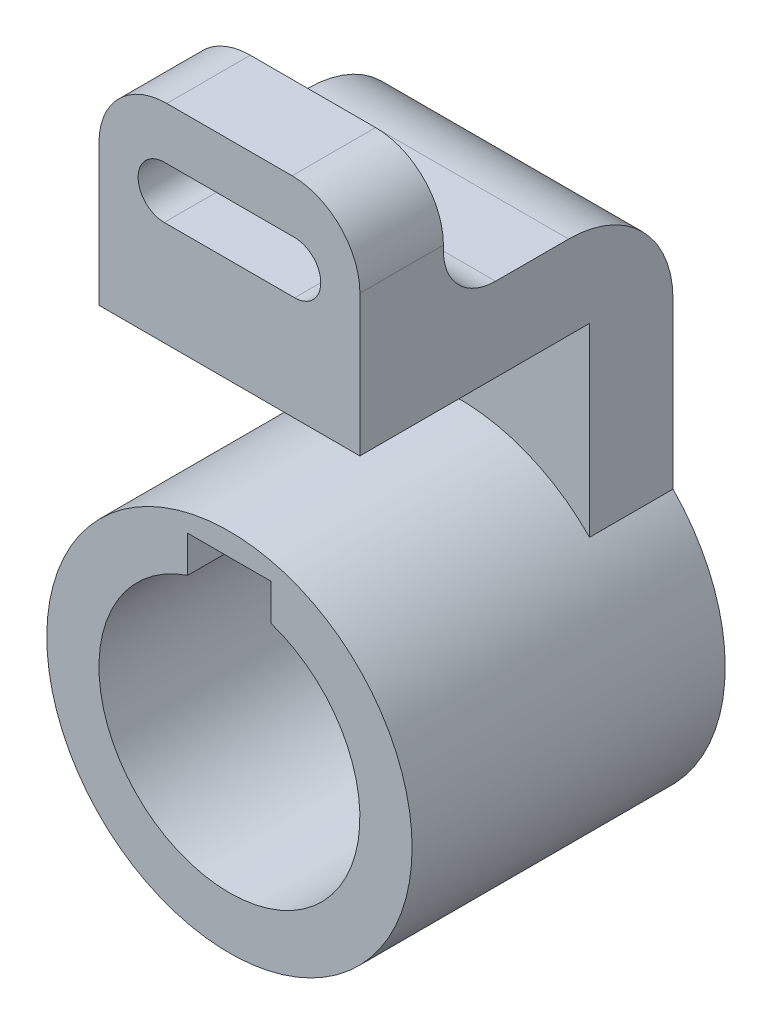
ISO-10303-21;
HEADER;
FILE_DESCRIPTION(('STEP AP214'),'2;1');
FILE_NAME('part.step','',(''),(''),'','','');
FILE_SCHEMA(('AUTOMOTIVE_DESIGN { 1 0 10303 214 1 1 1 1 }'));
ENDSEC;
DATA;
#1=APPLICATION_CONTEXT('core data for automotive mechanical design processes');
#2=APPLICATION_PROTOCOL_DEFINITION('international standard','automotive_design',2000,#1);
#3=PRODUCT_CONTEXT('',#1,'mechanical');
#4=PRODUCT('Part','Part','',(#3));
#5=PRODUCT_RELATED_PRODUCT_CATEGORY('part','',(#4));
#6=PRODUCT_DEFINITION_FORMATION('','',#4);
#7=PRODUCT_DEFINITION_CONTEXT('part definition',#1,'design');
#8=PRODUCT_DEFINITION('design','',#6,#7);
#9=PRODUCT_DEFINITION_SHAPE('','',#8);
#10=(LENGTH_UNIT() NAMED_UNIT(*) SI_UNIT(.MILLI.,.METRE.));
#11=(NAMED_UNIT(*) PLANE_ANGLE_UNIT() SI_UNIT($,.RADIAN.));
#12=(NAMED_UNIT(*) SI_UNIT($,.STERADIAN.) SOLID_ANGLE_UNIT());
#13=UNCERTAINTY_MEASURE_WITH_UNIT(LENGTH_MEASURE(1.E-05),#10,'distance_accuracy_value','');
#14=(GEOMETRIC_REPRESENTATION_CONTEXT(3) GLOBAL_UNCERTAINTY_ASSIGNED_CONTEXT((#13)) GLOBAL_UNIT_ASSIGNED_CONTEXT((#10,
#11,#12)) REPRESENTATION_CONTEXT('',''));
#15=CARTESIAN_POINT('',(0.,0.,0.));
#16=DIRECTION('',(0.,0.,1.));
#17=DIRECTION('',(1.,0.,0.));
#18=AXIS2_PLACEMENT_3D('',#15,#16,#17);
#19=CARTESIAN_POINT('',(0.,0.,60.));
#20=DIRECTION('',(0.,0.,-1.));
#21=DIRECTION('',(-1.,0.,0.));
#22=AXIS2_PLACEMENT_3D('',#19,#20,#21);
#23=CYLINDRICAL_SURFACE('',#22,35.);
#24=CARTESIAN_POINT('',(0.,0.,60.));
#25=DIRECTION('',(0.,0.,1.));
#26=DIRECTION('',(1.,0.,0.));
#27=AXIS2_PLACEMENT_3D('',#24,#25,#26);
#28=CIRCLE('',#27,35.);
#29=CARTESIAN_POINT('',(35.,0.,60.));
#30=VERTEX_POINT('',#29);
#31=EDGE_CURVE('E302',#30,#30,#28,.T.);
#32=ORIENTED_EDGE('',*,*,#31,.F.);
#33=EDGE_LOOP('',(#32));
#34=FACE_BOUND('',#33,.T.);
#35=CARTESIAN_POINT('',(0.,0.,0.));
#36=DIRECTION('',(0.,0.,1.));
#37=DIRECTION('',(1.,0.,0.));
#38=AXIS2_PLACEMENT_3D('',#35,#36,#37);
#39=CIRCLE('',#38,35.);
#40=CARTESIAN_POINT('',(-25.,24.4948974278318,0.));
#41=VERTEX_POINT('',#40);
#42=CARTESIAN_POINT('',(25.,24.4948974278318,0.));
#43=VERTEX_POINT('',#42);
#44=EDGE_CURVE('E300',#41,#43,#39,.T.);
#45=ORIENTED_EDGE('',*,*,#44,.T.);
#46=DIRECTION('',(0.,0.,-1.));
#47=VECTOR('',#46,1.);
#48=CARTESIAN_POINT('',(25.,24.4948974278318,60.));
#49=LINE('',#48,#47);
#50=CARTESIAN_POINT('',(25.,24.4948974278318,16.));
#51=VERTEX_POINT('',#50);
#52=EDGE_CURVE('E298',#43,#51,#49,.F.);
#53=ORIENTED_EDGE('',*,*,#52,.T.);
#54=CARTESIAN_POINT('',(0.,0.,16.));
#55=DIRECTION('',(0.,0.,-1.));
#56=DIRECTION('',(-1.,0.,0.));
#57=AXIS2_PLACEMENT_3D('',#54,#55,#56);
#58=CIRCLE('',#57,35.);
#59=CARTESIAN_POINT('',(-25.,24.4948974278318,16.));
#60=VERTEX_POINT('',#59);
#61=EDGE_CURVE('E305',#60,#51,#58,.T.);
#62=ORIENTED_EDGE('',*,*,#61,.F.);
#63=DIRECTION('',(0.,0.,-1.));
#64=VECTOR('',#63,1.);
#65=CARTESIAN_POINT('',(-25.,24.4948974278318,60.));
#66=LINE('',#65,#64);
#67=EDGE_CURVE('E295',#41,#60,#66,.F.);
#68=ORIENTED_EDGE('',*,*,#67,.F.);
#69=EDGE_LOOP('',(#45,#53,#62,#68));
#70=FACE_BOUND('',#69,.T.);
#71=ADVANCED_FACE('F45',(#34,#70),#23,.T.);
#72=CARTESIAN_POINT('',(0.,0.,60.));
#73=DIRECTION('',(0.,0.,1.));
#74=DIRECTION('',(1.,0.,0.));
#75=AXIS2_PLACEMENT_3D('',#72,#73,#74);
#76=PLANE('',#75);
#77=DIRECTION('',(-1.,0.,0.));
#78=VECTOR('',#77,1.);
#79=CARTESIAN_POINT('',(8.,30.685438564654,60.));
#80=LINE('',#79,#78);
#81=CARTESIAN_POINT('',(8.,30.685438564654,60.));
#82=VERTEX_POINT('',#81);
#83=CARTESIAN_POINT('',(-8.,30.685438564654,60.));
#84=VERTEX_POINT('',#83);
#85=EDGE_CURVE('E221',#82,#84,#80,.T.);
#86=ORIENTED_EDGE('',*,*,#85,.F.);
#87=DIRECTION('',(0.,1.,0.));
#88=VECTOR('',#87,1.);
#89=CARTESIAN_POINT('',(8.,23.685438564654,60.));
#90=LINE('',#89,#88);
#91=CARTESIAN_POINT('',(8.,23.685438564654,60.));
#92=VERTEX_POINT('',#91);
#93=EDGE_CURVE('E229',#92,#82,#90,.T.);
#94=ORIENTED_EDGE('',*,*,#93,.F.);
#95=CARTESIAN_POINT('',(0.,0.,60.));
#96=DIRECTION('',(0.,0.,1.));
#97=DIRECTION('',(1.,0.,0.));
#98=AXIS2_PLACEMENT_3D('',#95,#96,#97);
#99=CIRCLE('',#98,25.);
#100=CARTESIAN_POINT('',(-8.,23.685438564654,60.));
#101=VERTEX_POINT('',#100);
#102=EDGE_CURVE('E226',#101,#92,#99,.T.);
#103=ORIENTED_EDGE('',*,*,#102,.F.);
#104=DIRECTION('',(0.,-1.,0.));
#105=VECTOR('',#104,1.);
#106=CARTESIAN_POINT('',(-8.,23.685438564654,60.));
#107=LINE('',#106,#105);
#108=EDGE_CURVE('E223',#84,#101,#107,.T.);
#109=ORIENTED_EDGE('',*,*,#108,.F.);
#110=EDGE_LOOP('',(#86,#94,#103,#109));
#111=FACE_BOUND('',#110,.T.);
#112=ORIENTED_EDGE('',*,*,#31,.T.);
#113=EDGE_LOOP('',(#112));
#114=FACE_BOUND('',#113,.T.);
#115=ADVANCED_FACE('F383',(#111,#114),#76,.T.);
#116=CARTESIAN_POINT('',(0.,0.,0.));
#117=DIRECTION('',(0.,0.,1.));
#118=DIRECTION('',(1.,0.,0.));
#119=AXIS2_PLACEMENT_3D('',#116,#117,#118);
#120=PLANE('',#119);
#121=DIRECTION('',(0.,1.,0.));
#122=VECTOR('',#121,1.);
#123=CARTESIAN_POINT('',(8.,23.685438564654,0.));
#124=LINE('',#123,#122);
#125=CARTESIAN_POINT('',(8.,23.685438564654,0.));
#126=VERTEX_POINT('',#125);
#127=CARTESIAN_POINT('',(8.,30.685438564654,0.));
#128=VERTEX_POINT('',#127);
#129=EDGE_CURVE('E241',#126,#128,#124,.T.);
#130=ORIENTED_EDGE('',*,*,#129,.T.);
#131=DIRECTION('',(-1.,0.,0.));
#132=VECTOR('',#131,1.);
#133=CARTESIAN_POINT('',(8.,30.685438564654,0.));
#134=LINE('',#133,#132);
#135=CARTESIAN_POINT('',(-8.,30.685438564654,0.));
#136=VERTEX_POINT('',#135);
#137=EDGE_CURVE('E232',#128,#136,#134,.T.);
#138=ORIENTED_EDGE('',*,*,#137,.T.);
#139=DIRECTION('',(0.,-1.,0.));
#140=VECTOR('',#139,1.);
#141=CARTESIAN_POINT('',(-8.,23.685438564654,0.));
#142=LINE('',#141,#140);
#143=CARTESIAN_POINT('',(-8.,23.685438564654,0.));
#144=VERTEX_POINT('',#143);
#145=EDGE_CURVE('E235',#136,#144,#142,.T.);
#146=ORIENTED_EDGE('',*,*,#145,.T.);
#147=CARTESIAN_POINT('',(0.,0.,0.));
#148=DIRECTION('',(0.,0.,1.));
#149=DIRECTION('',(1.,0.,0.));
#150=AXIS2_PLACEMENT_3D('',#147,#148,#149);
#151=CIRCLE('',#150,25.);
#152=EDGE_CURVE('E238',#144,#126,#151,.T.);
#153=ORIENTED_EDGE('',*,*,#152,.T.);
#154=EDGE_LOOP('',(#130,#138,#146,#153));
#155=FACE_BOUND('',#154,.T.);
#156=DIRECTION('',(0.,1.,0.));
#157=VECTOR('',#156,1.);
#158=CARTESIAN_POINT('',(-25.,0.,0.));
#159=LINE('',#158,#157);
#160=CARTESIAN_POINT('',(-25.,56.,0.));
#161=VERTEX_POINT('',#160);
#162=EDGE_CURVE('E247',#41,#161,#159,.T.);
#163=ORIENTED_EDGE('',*,*,#162,.T.);
#164=DIRECTION('',(-1.,0.,0.));
#165=VECTOR('',#164,1.);
#166=CARTESIAN_POINT('',(0.,56.,0.));
#167=LINE('',#166,#165);
#168=CARTESIAN_POINT('',(25.,56.,0.));
#169=VERTEX_POINT('',#168);
#170=EDGE_CURVE('E333',#161,#169,#167,.F.);
#171=ORIENTED_EDGE('',*,*,#170,.T.);
#172=DIRECTION('',(0.,1.,0.));
#173=VECTOR('',#172,1.);
#174=CARTESIAN_POINT('',(25.,0.,0.));
#175=LINE('',#174,#173);
#176=EDGE_CURVE('E268',#43,#169,#175,.T.);
#177=ORIENTED_EDGE('',*,*,#176,.F.);
#178=ORIENTED_EDGE('',*,*,#44,.F.);
#179=EDGE_LOOP('',(#163,#171,#177,#178));
#180=FACE_BOUND('',#179,.T.);
#181=ADVANCED_FACE('F388',(#155,#180),#120,.F.);
#182=CARTESIAN_POINT('',(25.,0.,16.));
#183=DIRECTION('',(0.,0.,-1.));
#184=DIRECTION('',(-1.,0.,0.));
#185=AXIS2_PLACEMENT_3D('',#182,#183,#184);
#186=PLANE('',#185);
#187=DIRECTION('',(0.,-1.,0.));
#188=VECTOR('',#187,1.);
#189=CARTESIAN_POINT('',(-25.,0.,16.));
#190=LINE('',#189,#188);
#191=CARTESIAN_POINT('',(-25.,60.,16.));
#192=VERTEX_POINT('',#191);
#193=EDGE_CURVE('E265',#192,#60,#190,.T.);
#194=ORIENTED_EDGE('',*,*,#193,.T.);
#195=ORIENTED_EDGE('',*,*,#61,.T.);
#196=DIRECTION('',(0.,-1.,0.));
#197=VECTOR('',#196,1.);
#198=CARTESIAN_POINT('',(25.,0.,16.));
#199=LINE('',#198,#197);
#200=CARTESIAN_POINT('',(25.,60.,16.));
#201=VERTEX_POINT('',#200);
#202=EDGE_CURVE('E280',#201,#51,#199,.T.);
#203=ORIENTED_EDGE('',*,*,#202,.F.);
#204=DIRECTION('',(-1.,0.,0.));
#205=VECTOR('',#204,1.);
#206=CARTESIAN_POINT('',(25.,60.,16.));
#207=LINE('',#206,#205);
#208=EDGE_CURVE('E283',#201,#192,#207,.T.);
#209=ORIENTED_EDGE('',*,*,#208,.T.);
#210=EDGE_LOOP('',(#194,#195,#203,#209));
#211=FACE_BOUND('',#210,.T.);
#212=ADVANCED_FACE('F433',(#211),#186,.F.);
#213=CARTESIAN_POINT('',(25.,0.,0.));
#214=DIRECTION('',(1.,0.,0.));
#215=DIRECTION('',(0.,0.,-1.));
#216=AXIS2_PLACEMENT_3D('',#213,#214,#215);
#217=PLANE('',#216);
#218=ORIENTED_EDGE('',*,*,#176,.T.);
#219=CARTESIAN_POINT('',(25.,56.,20.));
#220=DIRECTION('',(1.,0.,0.));
#221=DIRECTION('',(0.,0.,-1.));
#222=AXIS2_PLACEMENT_3D('',#219,#220,#221);
#223=CIRCLE('',#222,20.);
#224=CARTESIAN_POINT('',(25.,76.,20.));
#225=VERTEX_POINT('',#224);
#226=EDGE_CURVE('E335',#169,#225,#223,.T.);
#227=ORIENTED_EDGE('',*,*,#226,.T.);
#228=DIRECTION('',(0.,0.,1.));
#229=VECTOR('',#228,1.);
#230=CARTESIAN_POINT('',(25.,76.,0.));
#231=LINE('',#230,#229);
#232=CARTESIAN_POINT('',(25.,76.,34.));
#233=VERTEX_POINT('',#232);
#234=EDGE_CURVE('E271',#225,#233,#231,.T.);
#235=ORIENTED_EDGE('',*,*,#234,.T.);
#236=CARTESIAN_POINT('',(25.,86.,34.));
#237=DIRECTION('',(1.,0.,0.));
#238=DIRECTION('',(0.,0.,-1.));
#239=AXIS2_PLACEMENT_3D('',#236,#237,#238);
#240=CIRCLE('',#239,10.);
#241=CARTESIAN_POINT('',(25.,86.,44.));
#242=VERTEX_POINT('',#241);
#243=EDGE_CURVE('E13',#233,#242,#240,.F.);
#244=ORIENTED_EDGE('',*,*,#243,.T.);
#245=DIRECTION('',(0.,1.,0.));
#246=VECTOR('',#245,1.);
#247=CARTESIAN_POINT('',(25.,76.,44.));
#248=LINE('',#247,#246);
#249=CARTESIAN_POINT('',(25.,87.,44.));
#250=VERTEX_POINT('',#249);
#251=EDGE_CURVE('E274',#242,#250,#248,.T.);
#252=ORIENTED_EDGE('',*,*,#251,.T.);
#253=DIRECTION('',(0.,0.,1.));
#254=VECTOR('',#253,1.);
#255=CARTESIAN_POINT('',(25.,87.,60.));
#256=LINE('',#255,#254);
#257=CARTESIAN_POINT('',(25.,87.,60.));
#258=VERTEX_POINT('',#257);
#259=EDGE_CURVE('E325',#250,#258,#256,.T.);
#260=ORIENTED_EDGE('',*,*,#259,.T.);
#261=DIRECTION('',(0.,-1.,0.));
#262=VECTOR('',#261,1.);
#263=CARTESIAN_POINT('',(25.,60.,60.));
#264=LINE('',#263,#262);
#265=CARTESIAN_POINT('',(25.,60.,60.));
#266=VERTEX_POINT('',#265);
#267=EDGE_CURVE('E276',#258,#266,#264,.T.);
#268=ORIENTED_EDGE('',*,*,#267,.T.);
#269=DIRECTION('',(0.,0.,-1.));
#270=VECTOR('',#269,1.);
#271=CARTESIAN_POINT('',(25.,60.,16.));
#272=LINE('',#271,#270);
#273=EDGE_CURVE('E278',#266,#201,#272,.T.);
#274=ORIENTED_EDGE('',*,*,#273,.T.);
#275=ORIENTED_EDGE('',*,*,#202,.T.);
#276=ORIENTED_EDGE('',*,*,#52,.F.);
#277=EDGE_LOOP('',(#218,#227,#235,#244,#252,#260,#268,#274,#275,#276));
#278=FACE_BOUND('',#277,.T.);
#279=ADVANCED_FACE('F398',(#278),#217,.T.);
#280=CARTESIAN_POINT('',(-25.,0.,0.));
#281=DIRECTION('',(1.,0.,0.));
#282=DIRECTION('',(0.,0.,-1.));
#283=AXIS2_PLACEMENT_3D('',#280,#281,#282);
#284=PLANE('',#283);
#285=DIRECTION('',(0.,0.,1.));
#286=VECTOR('',#285,1.);
#287=CARTESIAN_POINT('',(-25.,76.,0.));
#288=LINE('',#287,#286);
#289=CARTESIAN_POINT('',(-25.,76.,20.));
#290=VERTEX_POINT('',#289);
#291=CARTESIAN_POINT('',(-25.,76.,34.));
#292=VERTEX_POINT('',#291);
#293=EDGE_CURVE('E256',#290,#292,#288,.T.);
#294=ORIENTED_EDGE('',*,*,#293,.F.);
#295=CARTESIAN_POINT('',(-25.,56.,20.));
#296=DIRECTION('',(1.,0.,0.));
#297=DIRECTION('',(0.,0.,-1.));
#298=AXIS2_PLACEMENT_3D('',#295,#296,#297);
#299=CIRCLE('',#298,20.);
#300=EDGE_CURVE('E331',#290,#161,#299,.F.);
#301=ORIENTED_EDGE('',*,*,#300,.T.);
#302=ORIENTED_EDGE('',*,*,#162,.F.);
#303=ORIENTED_EDGE('',*,*,#67,.T.);
#304=ORIENTED_EDGE('',*,*,#193,.F.);
#305=DIRECTION('',(0.,0.,-1.));
#306=VECTOR('',#305,1.);
#307=CARTESIAN_POINT('',(-25.,60.,16.));
#308=LINE('',#307,#306);
#309=CARTESIAN_POINT('',(-25.,60.,60.));
#310=VERTEX_POINT('',#309);
#311=EDGE_CURVE('E263',#310,#192,#308,.T.);
#312=ORIENTED_EDGE('',*,*,#311,.F.);
#313=DIRECTION('',(0.,-1.,0.));
#314=VECTOR('',#313,1.);
#315=CARTESIAN_POINT('',(-25.,60.,60.));
#316=LINE('',#315,#314);
#317=CARTESIAN_POINT('',(-25.,87.,60.));
#318=VERTEX_POINT('',#317);
#319=EDGE_CURVE('E261',#318,#310,#316,.T.);
#320=ORIENTED_EDGE('',*,*,#319,.F.);
#321=DIRECTION('',(0.,0.,1.));
#322=VECTOR('',#321,1.);
#323=CARTESIAN_POINT('',(-25.,87.,0.));
#324=LINE('',#323,#322);
#325=CARTESIAN_POINT('',(-25.,87.,44.));
#326=VERTEX_POINT('',#325);
#327=EDGE_CURVE('E317',#318,#326,#324,.F.);
#328=ORIENTED_EDGE('',*,*,#327,.T.);
#329=DIRECTION('',(0.,1.,0.));
#330=VECTOR('',#329,1.);
#331=CARTESIAN_POINT('',(-25.,76.,44.));
#332=LINE('',#331,#330);
#333=CARTESIAN_POINT('',(-25.,86.,44.));
#334=VERTEX_POINT('',#333);
#335=EDGE_CURVE('E259',#334,#326,#332,.T.);
#336=ORIENTED_EDGE('',*,*,#335,.F.);
#337=CARTESIAN_POINT('',(-25.,86.,34.));
#338=DIRECTION('',(1.,0.,0.));
#339=DIRECTION('',(0.,0.,-1.));
#340=AXIS2_PLACEMENT_3D('',#337,#338,#339);
#341=CIRCLE('',#340,10.);
#342=EDGE_CURVE('E52',#334,#292,#341,.T.);
#343=ORIENTED_EDGE('',*,*,#342,.T.);
#344=EDGE_LOOP('',(#294,#301,#302,#303,#304,#312,#320,#328,#336,#343));
#345=FACE_BOUND('',#344,.T.);
#346=ADVANCED_FACE('F435',(#345),#284,.F.);
#347=CARTESIAN_POINT('',(25.,76.,0.));
#348=DIRECTION('',(0.,-1.,0.));
#349=DIRECTION('',(0.,0.,-1.));
#350=AXIS2_PLACEMENT_3D('',#347,#348,#349);
#351=PLANE('',#350);
#352=ORIENTED_EDGE('',*,*,#293,.T.);
#353=DIRECTION('',(-1.,0.,0.));
#354=VECTOR('',#353,1.);
#355=CARTESIAN_POINT('',(25.,76.,34.));
#356=LINE('',#355,#354);
#357=EDGE_CURVE('E342',#292,#233,#356,.F.);
#358=ORIENTED_EDGE('',*,*,#357,.T.);
#359=ORIENTED_EDGE('',*,*,#234,.F.);
#360=DIRECTION('',(-1.,0.,0.));
#361=VECTOR('',#360,1.);
#362=CARTESIAN_POINT('',(25.,76.,20.));
#363=LINE('',#362,#361);
#364=EDGE_CURVE('E328',#225,#290,#363,.T.);
#365=ORIENTED_EDGE('',*,*,#364,.T.);
#366=EDGE_LOOP('',(#352,#358,#359,#365));
#367=FACE_BOUND('',#366,.T.);
#368=ADVANCED_FACE('F407',(#367),#351,.F.);
#369=CARTESIAN_POINT('',(25.,76.,44.));
#370=DIRECTION('',(0.,0.,1.));
#371=DIRECTION('',(1.,0.,0.));
#372=AXIS2_PLACEMENT_3D('',#369,#370,#371);
#373=PLANE('',#372);
#374=ORIENTED_EDGE('',*,*,#251,.F.);
#375=DIRECTION('',(-1.,0.,0.));
#376=VECTOR('',#375,1.);
#377=CARTESIAN_POINT('',(-25.,86.,44.));
#378=LINE('',#377,#376);
#379=CARTESIAN_POINT('',(17.3989794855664,86.,44.));
#380=VERTEX_POINT('',#379);
#381=EDGE_CURVE('E339',#242,#380,#378,.T.);
#382=ORIENTED_EDGE('',*,*,#381,.T.);
#383=CARTESIAN_POINT('',(12.5,85.,44.));
#384=DIRECTION('',(0.,0.,1.));
#385=DIRECTION('',(1.,0.,0.));
#386=AXIS2_PLACEMENT_3D('',#383,#384,#385);
#387=CIRCLE('',#386,5.);
#388=CARTESIAN_POINT('',(12.5,90.,44.));
#389=VERTEX_POINT('',#388);
#390=EDGE_CURVE('E219',#380,#389,#387,.T.);
#391=ORIENTED_EDGE('',*,*,#390,.T.);
#392=DIRECTION('',(-1.,0.,0.));
#393=VECTOR('',#392,1.);
#394=CARTESIAN_POINT('',(25.,90.,44.));
#395=LINE('',#394,#393);
#396=CARTESIAN_POINT('',(-12.5,90.,44.));
#397=VERTEX_POINT('',#396);
#398=EDGE_CURVE('E214',#389,#397,#395,.T.);
#399=ORIENTED_EDGE('',*,*,#398,.T.);
#400=CARTESIAN_POINT('',(-12.5,85.,44.));
#401=DIRECTION('',(0.,0.,1.));
#402=DIRECTION('',(1.,0.,0.));
#403=AXIS2_PLACEMENT_3D('',#400,#401,#402);
#404=CIRCLE('',#403,5.);
#405=CARTESIAN_POINT('',(-17.3989794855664,86.,44.));
#406=VERTEX_POINT('',#405);
#407=EDGE_CURVE('E191',#397,#406,#404,.T.);
#408=ORIENTED_EDGE('',*,*,#407,.T.);
#409=DIRECTION('',(-1.,0.,0.));
#410=VECTOR('',#409,1.);
#411=CARTESIAN_POINT('',(-25.,86.,44.));
#412=LINE('',#411,#410);
#413=EDGE_CURVE('E337',#406,#334,#412,.T.);
#414=ORIENTED_EDGE('',*,*,#413,.T.);
#415=ORIENTED_EDGE('',*,*,#335,.T.);
#416=CARTESIAN_POINT('',(-12.,87.,44.));
#417=DIRECTION('',(0.,0.,1.));
#418=DIRECTION('',(1.,0.,0.));
#419=AXIS2_PLACEMENT_3D('',#416,#417,#418);
#420=CIRCLE('',#419,13.);
#421=CARTESIAN_POINT('',(-12.,100.,44.));
#422=VERTEX_POINT('',#421);
#423=EDGE_CURVE('E323',#326,#422,#420,.F.);
#424=ORIENTED_EDGE('',*,*,#423,.T.);
#425=DIRECTION('',(-1.,0.,0.));
#426=VECTOR('',#425,1.);
#427=CARTESIAN_POINT('',(25.,100.,44.));
#428=LINE('',#427,#426);
#429=CARTESIAN_POINT('',(12.,100.,44.));
#430=VERTEX_POINT('',#429);
#431=EDGE_CURVE('E292',#430,#422,#428,.T.);
#432=ORIENTED_EDGE('',*,*,#431,.F.);
#433=CARTESIAN_POINT('',(12.,87.,44.));
#434=DIRECTION('',(0.,0.,1.));
#435=DIRECTION('',(1.,0.,0.));
#436=AXIS2_PLACEMENT_3D('',#433,#434,#435);
#437=CIRCLE('',#436,13.);
#438=EDGE_CURVE('E320',#430,#250,#437,.F.);
#439=ORIENTED_EDGE('',*,*,#438,.T.);
#440=EDGE_LOOP('',(#374,#382,#391,#399,#408,#414,#415,#424,#432,#439));
#441=FACE_BOUND('',#440,.T.);
#442=ADVANCED_FACE('F415',(#441),#373,.F.);
#443=CARTESIAN_POINT('',(25.,100.,44.));
#444=DIRECTION('',(0.,-1.,0.));
#445=DIRECTION('',(0.,0.,-1.));
#446=AXIS2_PLACEMENT_3D('',#443,#444,#445);
#447=PLANE('',#446);
#448=ORIENTED_EDGE('',*,*,#431,.T.);
#449=DIRECTION('',(0.,0.,1.));
#450=VECTOR('',#449,1.);
#451=CARTESIAN_POINT('',(-12.,100.,44.));
#452=LINE('',#451,#450);
#453=CARTESIAN_POINT('',(-12.,100.,60.));
#454=VERTEX_POINT('',#453);
#455=EDGE_CURVE('E310',#422,#454,#452,.T.);
#456=ORIENTED_EDGE('',*,*,#455,.T.);
#457=DIRECTION('',(-1.,0.,0.));
#458=VECTOR('',#457,1.);
#459=CARTESIAN_POINT('',(25.,100.,60.));
#460=LINE('',#459,#458);
#461=CARTESIAN_POINT('',(12.,100.,60.));
#462=VERTEX_POINT('',#461);
#463=EDGE_CURVE('E289',#462,#454,#460,.T.);
#464=ORIENTED_EDGE('',*,*,#463,.F.);
#465=DIRECTION('',(0.,0.,1.));
#466=VECTOR('',#465,1.);
#467=CARTESIAN_POINT('',(12.,100.,44.));
#468=LINE('',#467,#466);
#469=EDGE_CURVE('E308',#462,#430,#468,.F.);
#470=ORIENTED_EDGE('',*,*,#469,.T.);
#471=EDGE_LOOP('',(#448,#456,#464,#470));
#472=FACE_BOUND('',#471,.T.);
#473=ADVANCED_FACE('F472',(#472),#447,.F.);
#474=CARTESIAN_POINT('',(25.,60.,60.));
#475=DIRECTION('',(0.,0.,-1.));
#476=DIRECTION('',(-1.,0.,0.));
#477=AXIS2_PLACEMENT_3D('',#474,#475,#476);
#478=PLANE('',#477);
#479=DIRECTION('',(-1.,0.,0.));
#480=VECTOR('',#479,1.);
#481=CARTESIAN_POINT('',(-12.5,90.,60.));
#482=LINE('',#481,#480);
#483=CARTESIAN_POINT('',(12.5,90.,60.));
#484=VERTEX_POINT('',#483);
#485=CARTESIAN_POINT('',(-12.5,90.,60.));
#486=VERTEX_POINT('',#485);
#487=EDGE_CURVE('E199',#484,#486,#482,.T.);
#488=ORIENTED_EDGE('',*,*,#487,.F.);
#489=CARTESIAN_POINT('',(12.5,85.,60.));
#490=DIRECTION('',(0.,0.,1.));
#491=DIRECTION('',(-1.,0.,0.));
#492=AXIS2_PLACEMENT_3D('',#489,#490,#491);
#493=CIRCLE('',#492,5.);
#494=CARTESIAN_POINT('',(12.5,80.,60.));
#495=VERTEX_POINT('',#494);
#496=EDGE_CURVE('E204',#495,#484,#493,.T.);
#497=ORIENTED_EDGE('',*,*,#496,.F.);
#498=DIRECTION('',(1.,0.,0.));
#499=VECTOR('',#498,1.);
#500=CARTESIAN_POINT('',(12.5,80.,60.));
#501=LINE('',#500,#499);
#502=CARTESIAN_POINT('',(-12.5,80.,60.));
#503=VERTEX_POINT('',#502);
#504=EDGE_CURVE('E208',#503,#495,#501,.T.);
#505=ORIENTED_EDGE('',*,*,#504,.F.);
#506=CARTESIAN_POINT('',(-12.5,85.,60.));
#507=DIRECTION('',(0.,0.,1.));
#508=DIRECTION('',(1.,0.,0.));
#509=AXIS2_PLACEMENT_3D('',#506,#507,#508);
#510=CIRCLE('',#509,5.);
#511=EDGE_CURVE('E188',#486,#503,#510,.T.);
#512=ORIENTED_EDGE('',*,*,#511,.F.);
#513=EDGE_LOOP('',(#488,#497,#505,#512));
#514=FACE_BOUND('',#513,.T.);
#515=ORIENTED_EDGE('',*,*,#463,.T.);
#516=CARTESIAN_POINT('',(-12.,87.,60.));
#517=DIRECTION('',(0.,0.,-1.));
#518=DIRECTION('',(-1.,0.,0.));
#519=AXIS2_PLACEMENT_3D('',#516,#517,#518);
#520=CIRCLE('',#519,13.);
#521=EDGE_CURVE('E315',#454,#318,#520,.F.);
#522=ORIENTED_EDGE('',*,*,#521,.T.);
#523=ORIENTED_EDGE('',*,*,#319,.T.);
#524=DIRECTION('',(-1.,0.,0.));
#525=VECTOR('',#524,1.);
#526=CARTESIAN_POINT('',(25.,60.,60.));
#527=LINE('',#526,#525);
#528=EDGE_CURVE('E286',#266,#310,#527,.T.);
#529=ORIENTED_EDGE('',*,*,#528,.F.);
#530=ORIENTED_EDGE('',*,*,#267,.F.);
#531=CARTESIAN_POINT('',(12.,87.,60.));
#532=DIRECTION('',(0.,0.,-1.));
#533=DIRECTION('',(-1.,0.,0.));
#534=AXIS2_PLACEMENT_3D('',#531,#532,#533);
#535=CIRCLE('',#534,13.);
#536=EDGE_CURVE('E313',#258,#462,#535,.F.);
#537=ORIENTED_EDGE('',*,*,#536,.T.);
#538=EDGE_LOOP('',(#515,#522,#523,#529,#530,#537));
#539=FACE_BOUND('',#538,.T.);
#540=ADVANCED_FACE('F206',(#514,#539),#478,.F.);
#541=CARTESIAN_POINT('',(25.,60.,16.));
#542=DIRECTION('',(0.,1.,0.));
#543=DIRECTION('',(0.,0.,1.));
#544=AXIS2_PLACEMENT_3D('',#541,#542,#543);
#545=PLANE('',#544);
#546=ORIENTED_EDGE('',*,*,#311,.T.);
#547=ORIENTED_EDGE('',*,*,#208,.F.);
#548=ORIENTED_EDGE('',*,*,#273,.F.);
#549=ORIENTED_EDGE('',*,*,#528,.T.);
#550=EDGE_LOOP('',(#546,#547,#548,#549));
#551=FACE_BOUND('',#550,.T.);
#552=ADVANCED_FACE('F430',(#551),#545,.F.);
#553=CARTESIAN_POINT('',(8.,30.685438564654,0.));
#554=DIRECTION('',(0.,1.,0.));
#555=DIRECTION('',(0.,0.,1.));
#556=AXIS2_PLACEMENT_3D('',#553,#554,#555);
#557=PLANE('',#556);
#558=ORIENTED_EDGE('',*,*,#85,.T.);
#559=DIRECTION('',(0.,0.,1.));
#560=VECTOR('',#559,1.);
#561=CARTESIAN_POINT('',(-8.,30.685438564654,0.));
#562=LINE('',#561,#560);
#563=EDGE_CURVE('E244',#136,#84,#562,.T.);
#564=ORIENTED_EDGE('',*,*,#563,.F.);
#565=ORIENTED_EDGE('',*,*,#137,.F.);
#566=DIRECTION('',(0.,0.,1.));
#567=VECTOR('',#566,1.);
#568=CARTESIAN_POINT('',(8.,30.685438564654,0.));
#569=LINE('',#568,#567);
#570=EDGE_CURVE('E245',#128,#82,#569,.T.);
#571=ORIENTED_EDGE('',*,*,#570,.T.);
#572=EDGE_LOOP('',(#558,#564,#565,#571));
#573=FACE_BOUND('',#572,.T.);
#574=ADVANCED_FACE('F458',(#573),#557,.F.);
#575=CARTESIAN_POINT('',(8.,23.685438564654,0.));
#576=DIRECTION('',(1.,0.,0.));
#577=DIRECTION('',(0.,0.,-1.));
#578=AXIS2_PLACEMENT_3D('',#575,#576,#577);
#579=PLANE('',#578);
#580=ORIENTED_EDGE('',*,*,#93,.T.);
#581=ORIENTED_EDGE('',*,*,#570,.F.);
#582=ORIENTED_EDGE('',*,*,#129,.F.);
#583=DIRECTION('',(0.,0.,1.));
#584=VECTOR('',#583,1.);
#585=CARTESIAN_POINT('',(8.,23.685438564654,0.));
#586=LINE('',#585,#584);
#587=EDGE_CURVE('E248',#126,#92,#586,.T.);
#588=ORIENTED_EDGE('',*,*,#587,.T.);
#589=EDGE_LOOP('',(#580,#581,#582,#588));
#590=FACE_BOUND('',#589,.T.);
#591=ADVANCED_FACE('F454',(#590),#579,.F.);
#592=CARTESIAN_POINT('',(0.,0.,0.));
#593=DIRECTION('',(0.,0.,1.));
#594=DIRECTION('',(1.,0.,0.));
#595=AXIS2_PLACEMENT_3D('',#592,#593,#594);
#596=CYLINDRICAL_SURFACE('',#595,25.);
#597=ORIENTED_EDGE('',*,*,#102,.T.);
#598=ORIENTED_EDGE('',*,*,#587,.F.);
#599=ORIENTED_EDGE('',*,*,#152,.F.);
#600=DIRECTION('',(0.,0.,1.));
#601=VECTOR('',#600,1.);
#602=CARTESIAN_POINT('',(-8.,23.685438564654,0.));
#603=LINE('',#602,#601);
#604=EDGE_CURVE('E250',#144,#101,#603,.T.);
#605=ORIENTED_EDGE('',*,*,#604,.T.);
#606=EDGE_LOOP('',(#597,#598,#599,#605));
#607=FACE_BOUND('',#606,.T.);
#608=ADVANCED_FACE('F448',(#607),#596,.F.);
#609=CARTESIAN_POINT('',(-8.,23.685438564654,0.));
#610=DIRECTION('',(-1.,0.,0.));
#611=DIRECTION('',(0.,0.,1.));
#612=AXIS2_PLACEMENT_3D('',#609,#610,#611);
#613=PLANE('',#612);
#614=ORIENTED_EDGE('',*,*,#108,.T.);
#615=ORIENTED_EDGE('',*,*,#604,.F.);
#616=ORIENTED_EDGE('',*,*,#145,.F.);
#617=ORIENTED_EDGE('',*,*,#563,.T.);
#618=EDGE_LOOP('',(#614,#615,#616,#617));
#619=FACE_BOUND('',#618,.T.);
#620=ADVANCED_FACE('F443',(#619),#613,.F.);
#621=CARTESIAN_POINT('',(12.5,85.,0.));
#622=DIRECTION('',(0.,0.,1.));
#623=DIRECTION('',(1.,0.,0.));
#624=AXIS2_PLACEMENT_3D('',#621,#622,#623);
#625=CYLINDRICAL_SURFACE('',#624,5.);
#626=DIRECTION('',(0.,0.,1.));
#627=VECTOR('',#626,1.);
#628=CARTESIAN_POINT('',(12.5,80.,0.));
#629=LINE('',#628,#627);
#630=CARTESIAN_POINT('',(12.5,80.,42.));
#631=VERTEX_POINT('',#630);
#632=EDGE_CURVE('E66',#631,#495,#629,.T.);
#633=ORIENTED_EDGE('',*,*,#632,.T.);
#634=ORIENTED_EDGE('',*,*,#496,.T.);
#635=DIRECTION('',(0.,0.,1.));
#636=VECTOR('',#635,1.);
#637=CARTESIAN_POINT('',(12.5,90.,0.));
#638=LINE('',#637,#636);
#639=EDGE_CURVE('E195',#389,#484,#638,.T.);
#640=ORIENTED_EDGE('',*,*,#639,.F.);
#641=ORIENTED_EDGE('',*,*,#390,.F.);
#642=CARTESIAN_POINT('',(17.3989794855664,86.,44.));
#643=CARTESIAN_POINT('',(17.4249485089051,85.8728878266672,44.0000228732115));
#644=CARTESIAN_POINT('',(17.4459277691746,85.7447581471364,43.9975772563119));
#645=CARTESIAN_POINT('',(17.4778618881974,85.487475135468,43.9876806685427));
#646=CARTESIAN_POINT('',(17.4888189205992,85.3583220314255,43.9802307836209));
#647=CARTESIAN_POINT('',(17.5006508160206,85.1004747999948,43.9602981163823));
#648=CARTESIAN_POINT('',(17.5015666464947,84.9717809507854,43.9478359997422));
#649=CARTESIAN_POINT('',(17.4935356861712,84.7152823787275,43.9179719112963));
#650=CARTESIAN_POINT('',(17.4845888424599,84.5874776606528,43.9005699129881));
#651=CARTESIAN_POINT('',(17.4570512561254,84.3337303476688,43.8610352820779));
#652=CARTESIAN_POINT('',(17.4384663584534,84.2077866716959,43.8389055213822));
#653=CARTESIAN_POINT('',(17.391968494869,83.9584874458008,43.7902194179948));
#654=CARTESIAN_POINT('',(17.3640519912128,83.8351328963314,43.7636613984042));
#655=CARTESIAN_POINT('',(17.2668193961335,83.4700455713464,43.6778937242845));
#656=CARTESIAN_POINT('',(17.184009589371,83.2331945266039,43.612575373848));
#657=CARTESIAN_POINT('',(16.9813032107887,82.7671572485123,43.4663228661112));
#658=CARTESIAN_POINT('',(16.8598638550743,82.5388368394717,43.3848046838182));
#659=CARTESIAN_POINT('',(16.5851100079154,82.1055664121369,43.2134532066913));
#660=CARTESIAN_POINT('',(16.4317706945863,81.9006347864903,43.1236134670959));
#661=CARTESIAN_POINT('',(16.0758806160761,81.4935990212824,42.9302352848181));
#662=CARTESIAN_POINT('',(15.8696063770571,81.2948989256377,42.8263641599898));
#663=CARTESIAN_POINT('',(15.4244381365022,80.9343222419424,42.6244776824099));
#664=CARTESIAN_POINT('',(15.1855434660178,80.7724464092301,42.5264624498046));
#665=CARTESIAN_POINT('',(14.7159909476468,80.5110835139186,42.3601550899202));
#666=CARTESIAN_POINT('',(14.4893392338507,80.4059103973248,42.28961095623));
#667=CARTESIAN_POINT('',(14.136494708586,80.2737283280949,42.198333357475));
#668=CARTESIAN_POINT('',(14.0168495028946,80.2339550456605,42.1703493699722));
#669=CARTESIAN_POINT('',(13.7738147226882,80.1633269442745,42.1200445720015));
#670=CARTESIAN_POINT('',(13.6504261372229,80.1324697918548,42.0977222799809));
#671=CARTESIAN_POINT('',(13.3585327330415,80.0713113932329,42.0531093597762));
#672=CARTESIAN_POINT('',(13.1888256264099,80.0446955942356,42.0333600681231));
#673=CARTESIAN_POINT('',(12.9319770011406,80.0179458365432,42.0134347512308));
#674=CARTESIAN_POINT('',(12.8458252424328,80.011224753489,42.0084091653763));
#675=CARTESIAN_POINT('',(12.6731251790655,80.002249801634,42.0016878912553));
#676=CARTESIAN_POINT('',(12.5865767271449,79.999997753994,41.9999935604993));
#677=CARTESIAN_POINT('',(12.5,80.,42.));
#678=B_SPLINE_CURVE_WITH_KNOTS('',3,(#642,#643,#644,#645,#646,#647,#648,#649,#650,#651,#652,
#653,#654,#655,#656,#657,#658,#659,#660,#661,#662,#663,#664,#665,#666,#667,#668,#669,#670,#671,
#672,#673,#674,#675,#676,#677),.UNSPECIFIED.,.F.,.F.,(4,2,2,2,2,2,2,2,2,2,2,2,2,2,2,2,2,4),(0.,
0.389088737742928,0.778093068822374,1.1655096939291,1.55292839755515,1.9401124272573,
2.32744341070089,3.1018196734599,3.91213342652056,4.72308007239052,5.63309855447,
6.54313570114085,7.31859759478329,7.70562835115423,8.09255772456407,8.60976792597,
8.86929156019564,9.12892093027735),.UNSPECIFIED.);
#679=EDGE_CURVE('E344',#380,#631,#678,.T.);
#680=ORIENTED_EDGE('',*,*,#679,.T.);
#681=EDGE_LOOP('',(#633,#634,#640,#641,#680));
#682=FACE_BOUND('',#681,.T.);
#683=ADVANCED_FACE('F353',(#682),#625,.F.);
#684=CARTESIAN_POINT('',(12.5,80.,0.));
#685=DIRECTION('',(0.,-1.,0.));
#686=DIRECTION('',(0.,0.,-1.));
#687=AXIS2_PLACEMENT_3D('',#684,#685,#686);
#688=PLANE('',#687);
#689=DIRECTION('',(0.,0.,1.));
#690=VECTOR('',#689,1.);
#691=CARTESIAN_POINT('',(-12.5,80.,0.));
#692=LINE('',#691,#690);
#693=CARTESIAN_POINT('',(-12.5,80.,42.));
#694=VERTEX_POINT('',#693);
#695=EDGE_CURVE('E59',#694,#503,#692,.T.);
#696=ORIENTED_EDGE('',*,*,#695,.T.);
#697=ORIENTED_EDGE('',*,*,#504,.T.);
#698=ORIENTED_EDGE('',*,*,#632,.F.);
#699=DIRECTION('',(1.,0.,0.));
#700=VECTOR('',#699,1.);
#701=CARTESIAN_POINT('',(12.5,80.,42.));
#702=LINE('',#701,#700);
#703=EDGE_CURVE('E351',#631,#694,#702,.F.);
#704=ORIENTED_EDGE('',*,*,#703,.T.);
#705=EDGE_LOOP('',(#696,#697,#698,#704));
#706=FACE_BOUND('',#705,.T.);
#707=ADVANCED_FACE('F373',(#706),#688,.F.);
#708=CARTESIAN_POINT('',(-12.5,85.,0.));
#709=DIRECTION('',(0.,0.,1.));
#710=DIRECTION('',(1.,0.,0.));
#711=AXIS2_PLACEMENT_3D('',#708,#709,#710);
#712=CYLINDRICAL_SURFACE('',#711,5.);
#713=DIRECTION('',(0.,0.,1.));
#714=VECTOR('',#713,1.);
#715=CARTESIAN_POINT('',(-12.5,90.,0.));
#716=LINE('',#715,#714);
#717=EDGE_CURVE('E184',#397,#486,#716,.T.);
#718=ORIENTED_EDGE('',*,*,#717,.T.);
#719=ORIENTED_EDGE('',*,*,#511,.T.);
#720=ORIENTED_EDGE('',*,*,#695,.F.);
#721=CARTESIAN_POINT('',(-12.5,80.,42.));
#722=CARTESIAN_POINT('',(-12.6256046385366,79.9999722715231,41.9999528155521));
#723=CARTESIAN_POINT('',(-12.7511807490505,80.0047318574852,42.0035484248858));
#724=CARTESIAN_POINT('',(-13.0011267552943,80.0236066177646,42.0176662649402));
#725=CARTESIAN_POINT('',(-13.1254976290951,80.037713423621,42.0281822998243));
#726=CARTESIAN_POINT('',(-13.3711582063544,80.0749197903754,42.0556764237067));
#727=CARTESIAN_POINT('',(-13.4924643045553,80.0979489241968,42.0726038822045));
#728=CARTESIAN_POINT('',(-13.7321250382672,80.1526304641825,42.1123000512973));
#729=CARTESIAN_POINT('',(-13.8504791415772,80.1842844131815,42.1350698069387));
#730=CARTESIAN_POINT('',(-14.1992035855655,80.2913273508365,42.210889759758));
#731=CARTESIAN_POINT('',(-14.4242829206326,80.3789608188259,42.2715781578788));
#732=CARTESIAN_POINT('',(-14.8563788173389,80.5835651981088,42.4069759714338));
#733=CARTESIAN_POINT('',(-15.0633559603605,80.7005980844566,42.4817149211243));
#734=CARTESIAN_POINT('',(-15.4793961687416,80.9760230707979,42.6480297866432));
#735=CARTESIAN_POINT('',(-15.6859508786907,81.13762718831,42.7405534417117));
#736=CARTESIAN_POINT('',(-16.0709899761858,81.4905514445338,42.92775050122));
#737=CARTESIAN_POINT('',(-16.2494629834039,81.6818835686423,43.0224247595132));
#738=CARTESIAN_POINT('',(-16.5048266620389,82.0027597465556,43.1672464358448));
#739=CARTESIAN_POINT('',(-16.5923072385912,82.1233160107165,43.2189706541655));
#740=CARTESIAN_POINT('',(-16.7565842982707,82.3725028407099,43.3198336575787));
#741=CARTESIAN_POINT('',(-16.8333844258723,82.5011306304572,43.3689733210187));
#742=CARTESIAN_POINT('',(-16.9756080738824,82.7658311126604,43.463610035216));
#743=CARTESIAN_POINT('',(-17.0410301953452,82.9019047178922,43.5091066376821));
#744=CARTESIAN_POINT('',(-17.1597186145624,83.1806699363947,43.5954498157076));
#745=CARTESIAN_POINT('',(-17.2129864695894,83.3233606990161,43.636296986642));
#746=CARTESIAN_POINT('',(-17.3041540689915,83.606769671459,43.7104464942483));
#747=CARTESIAN_POINT('',(-17.3427105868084,83.7472024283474,43.7440312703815));
#748=CARTESIAN_POINT('',(-17.4075904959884,84.032070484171,43.8055329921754));
#749=CARTESIAN_POINT('',(-17.4339158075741,84.1765051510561,43.8334508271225));
#750=CARTESIAN_POINT('',(-17.4737841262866,84.4679572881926,43.8830490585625));
#751=CARTESIAN_POINT('',(-17.4873468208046,84.6149704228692,43.9047390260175));
#752=CARTESIAN_POINT('',(-17.5013816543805,84.9103681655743,43.9415717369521));
#753=CARTESIAN_POINT('',(-17.5018608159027,85.058751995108,43.9567179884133));
#754=CARTESIAN_POINT('',(-17.4901948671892,85.3400759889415,43.9790913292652));
#755=CARTESIAN_POINT('',(-17.4793555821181,85.4730197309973,43.9869774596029));
#756=CARTESIAN_POINT('',(-17.4470861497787,85.7376637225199,43.9974409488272));
#757=CARTESIAN_POINT('',(-17.4256687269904,85.8693652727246,44.0000246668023));
#758=CARTESIAN_POINT('',(-17.3989794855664,86.,44.));
#759=B_SPLINE_CURVE_WITH_KNOTS('',3,(#721,#722,#723,#724,#725,#726,#727,#728,#729,#730,#731,
#732,#733,#734,#735,#736,#737,#738,#739,#740,#741,#742,#743,#744,#745,#746,#747,#748,#749,#750,
#751,#752,#753,#754,#755,#756,#757,#758),.UNSPECIFIED.,.F.,.F.,(4,2,2,2,2,2,2,2,2,2,2,2,2,2,2,2,
2,2,4),(0.,0.37662603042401,0.752915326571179,1.12629304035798,1.4997375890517,2.24346601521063,
2.98877560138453,3.8199751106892,4.65151060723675,5.12403918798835,5.59640613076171,
6.06883111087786,6.54119552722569,6.98891675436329,7.43656766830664,7.8835269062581,
8.33024623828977,8.73057511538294,9.13042360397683),.UNSPECIFIED.);
#760=EDGE_CURVE('E365',#694,#406,#759,.T.);
#761=ORIENTED_EDGE('',*,*,#760,.T.);
#762=ORIENTED_EDGE('',*,*,#407,.F.);
#763=EDGE_LOOP('',(#718,#719,#720,#761,#762));
#764=FACE_BOUND('',#763,.T.);
#765=ADVANCED_FACE('F186',(#764),#712,.F.);
#766=CARTESIAN_POINT('',(-12.5,90.,0.));
#767=DIRECTION('',(0.,1.,0.));
#768=DIRECTION('',(0.,0.,1.));
#769=AXIS2_PLACEMENT_3D('',#766,#767,#768);
#770=PLANE('',#769);
#771=ORIENTED_EDGE('',*,*,#639,.T.);
#772=ORIENTED_EDGE('',*,*,#487,.T.);
#773=ORIENTED_EDGE('',*,*,#717,.F.);
#774=ORIENTED_EDGE('',*,*,#398,.F.);
#775=EDGE_LOOP('',(#771,#772,#773,#774));
#776=FACE_BOUND('',#775,.T.);
#777=ADVANCED_FACE('F200',(#776),#770,.F.);
#778=CARTESIAN_POINT('',(-12.,87.,44.));
#779=DIRECTION('',(0.,0.,1.));
#780=DIRECTION('',(1.,0.,0.));
#781=AXIS2_PLACEMENT_3D('',#778,#779,#780);
#782=CYLINDRICAL_SURFACE('',#781,13.);
#783=ORIENTED_EDGE('',*,*,#423,.F.);
#784=ORIENTED_EDGE('',*,*,#327,.F.);
#785=ORIENTED_EDGE('',*,*,#521,.F.);
#786=ORIENTED_EDGE('',*,*,#455,.F.);
#787=EDGE_LOOP('',(#783,#784,#785,#786));
#788=FACE_BOUND('',#787,.T.);
#789=ADVANCED_FACE('F376',(#788),#782,.T.);
#790=CARTESIAN_POINT('',(12.,87.,0.));
#791=DIRECTION('',(0.,0.,-1.));
#792=DIRECTION('',(-1.,0.,0.));
#793=AXIS2_PLACEMENT_3D('',#790,#791,#792);
#794=CYLINDRICAL_SURFACE('',#793,13.);
#795=ORIENTED_EDGE('',*,*,#438,.F.);
#796=ORIENTED_EDGE('',*,*,#469,.F.);
#797=ORIENTED_EDGE('',*,*,#536,.F.);
#798=ORIENTED_EDGE('',*,*,#259,.F.);
#799=EDGE_LOOP('',(#795,#796,#797,#798));
#800=FACE_BOUND('',#799,.T.);
#801=ADVANCED_FACE('F380',(#800),#794,.T.);
#802=CARTESIAN_POINT('',(25.,56.,20.));
#803=DIRECTION('',(-1.,0.,0.));
#804=DIRECTION('',(0.,0.,1.));
#805=AXIS2_PLACEMENT_3D('',#802,#803,#804);
#806=CYLINDRICAL_SURFACE('',#805,20.);
#807=ORIENTED_EDGE('',*,*,#226,.F.);
#808=ORIENTED_EDGE('',*,*,#170,.F.);
#809=ORIENTED_EDGE('',*,*,#300,.F.);
#810=ORIENTED_EDGE('',*,*,#364,.F.);
#811=EDGE_LOOP('',(#807,#808,#809,#810));
#812=FACE_BOUND('',#811,.T.);
#813=ADVANCED_FACE('F361',(#812),#806,.T.);
#814=CARTESIAN_POINT('',(25.,86.,34.));
#815=DIRECTION('',(1.,0.,0.));
#816=DIRECTION('',(0.,0.,-1.));
#817=AXIS2_PLACEMENT_3D('',#814,#815,#816);
#818=CYLINDRICAL_SURFACE('',#817,10.);
#819=ORIENTED_EDGE('',*,*,#243,.F.);
#820=ORIENTED_EDGE('',*,*,#357,.F.);
#821=ORIENTED_EDGE('',*,*,#342,.F.);
#822=ORIENTED_EDGE('',*,*,#413,.F.);
#823=ORIENTED_EDGE('',*,*,#760,.F.);
#824=ORIENTED_EDGE('',*,*,#703,.F.);
#825=ORIENTED_EDGE('',*,*,#679,.F.);
#826=ORIENTED_EDGE('',*,*,#381,.F.);
#827=EDGE_LOOP('',(#819,#820,#821,#822,#823,#824,#825,#826));
#828=FACE_BOUND('',#827,.T.);
#829=ADVANCED_FACE('F357',(#828),#818,.F.);
#830=CLOSED_SHELL('',(#71,#115,#181,#212,#279,#346,#368,#442,#473,#540,#552,#574,#591,#608,#620,
#683,#707,#765,#777,#789,#801,#813,#829));
#831=MANIFOLD_SOLID_BREP('B2',#830);
#832=ADVANCED_BREP_SHAPE_REPRESENTATION('',(#18,#831),#14);
#833=SHAPE_DEFINITION_REPRESENTATION(#9,#832);
ENDSEC;
END-ISO-10303-21;
